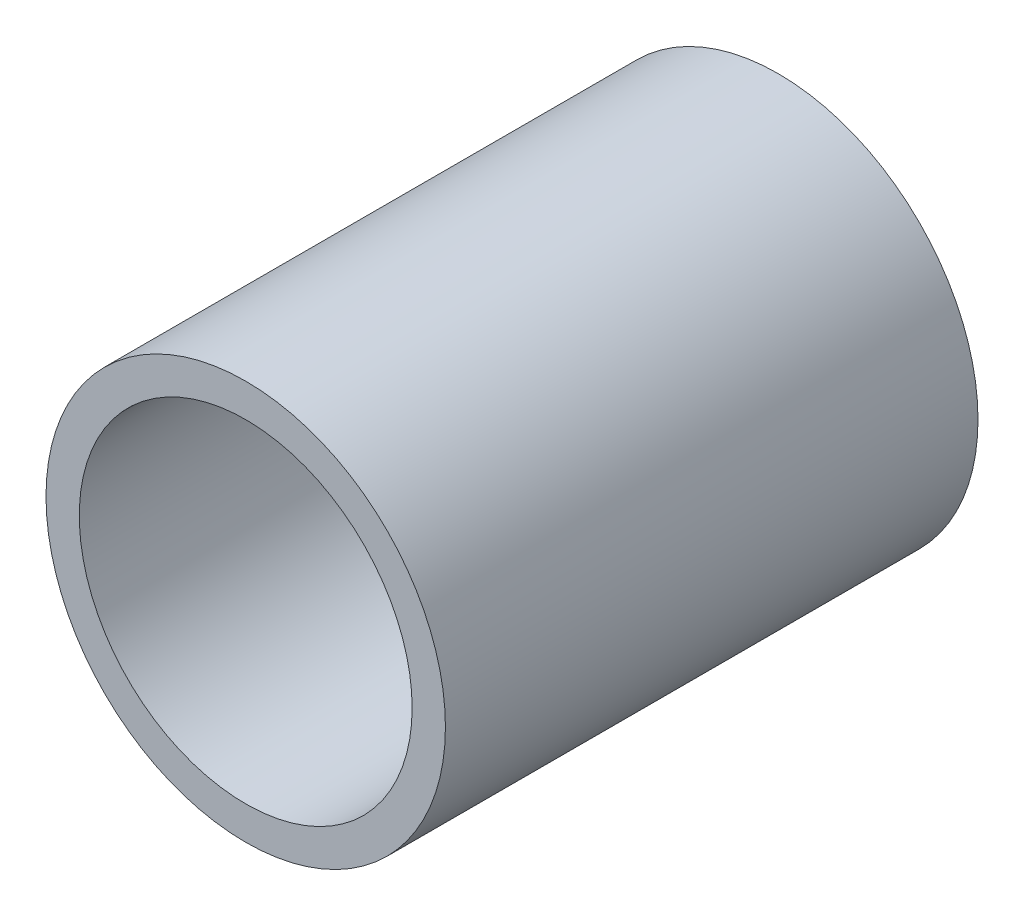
ISO-10303-21;
HEADER;
FILE_DESCRIPTION(('STEP AP214'),'2;1');
FILE_NAME('part.step','',(''),(''),'','','');
FILE_SCHEMA(('AUTOMOTIVE_DESIGN { 1 0 10303 214 1 1 1 1 }'));
ENDSEC;
DATA;
#1=APPLICATION_CONTEXT('core data for automotive mechanical design processes');
#2=APPLICATION_PROTOCOL_DEFINITION('international standard','automotive_design',2000,#1);
#3=PRODUCT_CONTEXT('',#1,'mechanical');
#4=PRODUCT('Part','Part','',(#3));
#5=PRODUCT_RELATED_PRODUCT_CATEGORY('part','',(#4));
#6=PRODUCT_DEFINITION_FORMATION('','',#4);
#7=PRODUCT_DEFINITION_CONTEXT('part definition',#1,'design');
#8=PRODUCT_DEFINITION('design','',#6,#7);
#9=PRODUCT_DEFINITION_SHAPE('','',#8);
#10=(LENGTH_UNIT() NAMED_UNIT(*) SI_UNIT(.MILLI.,.METRE.));
#11=(NAMED_UNIT(*) PLANE_ANGLE_UNIT() SI_UNIT($,.RADIAN.));
#12=(NAMED_UNIT(*) SI_UNIT($,.STERADIAN.) SOLID_ANGLE_UNIT());
#13=UNCERTAINTY_MEASURE_WITH_UNIT(LENGTH_MEASURE(1.E-05),#10,'distance_accuracy_value','');
#14=(GEOMETRIC_REPRESENTATION_CONTEXT(3) GLOBAL_UNCERTAINTY_ASSIGNED_CONTEXT((#13)) GLOBAL_UNIT_ASSIGNED_CONTEXT((#10,
#11,#12)) REPRESENTATION_CONTEXT('',''));
#15=CARTESIAN_POINT('',(0.,0.,0.));
#16=DIRECTION('',(0.,0.,1.));
#17=DIRECTION('',(1.,0.,0.));
#18=AXIS2_PLACEMENT_3D('',#15,#16,#17);
#19=CARTESIAN_POINT('',(0.,0.,50.8));
#20=DIRECTION('',(0.,0.,1.));
#21=DIRECTION('',(1.,0.,0.));
#22=AXIS2_PLACEMENT_3D('',#19,#20,#21);
#23=PLANE('',#22);
#24=CARTESIAN_POINT('',(0.,0.,50.8));
#25=DIRECTION('',(0.,0.,1.));
#26=DIRECTION('',(1.,0.,0.));
#27=AXIS2_PLACEMENT_3D('',#24,#25,#26);
#28=CIRCLE('',#27,19.05);
#29=CARTESIAN_POINT('',(19.05,0.,50.8));
#30=VERTEX_POINT('',#29);
#31=EDGE_CURVE('E10',#30,#30,#28,.T.);
#32=ORIENTED_EDGE('',*,*,#31,.T.);
#33=EDGE_LOOP('',(#32));
#34=FACE_BOUND('',#33,.T.);
#35=CARTESIAN_POINT('',(0.,0.,50.8));
#36=DIRECTION('',(0.,0.,1.));
#37=DIRECTION('',(1.,0.,0.));
#38=AXIS2_PLACEMENT_3D('',#35,#36,#37);
#39=CIRCLE('',#38,15.875);
#40=CARTESIAN_POINT('',(15.875,0.,50.8));
#41=VERTEX_POINT('',#40);
#42=EDGE_CURVE('E39',#41,#41,#39,.T.);
#43=ORIENTED_EDGE('',*,*,#42,.F.);
#44=EDGE_LOOP('',(#43));
#45=FACE_BOUND('',#44,.T.);
#46=ADVANCED_FACE('F28',(#34,#45),#23,.T.);
#47=CARTESIAN_POINT('',(0.,0.,0.));
#48=DIRECTION('',(0.,0.,1.));
#49=DIRECTION('',(1.,0.,0.));
#50=AXIS2_PLACEMENT_3D('',#47,#48,#49);
#51=PLANE('',#50);
#52=CARTESIAN_POINT('',(0.,0.,0.));
#53=DIRECTION('',(0.,0.,1.));
#54=DIRECTION('',(1.,0.,0.));
#55=AXIS2_PLACEMENT_3D('',#52,#53,#54);
#56=CIRCLE('',#55,19.05);
#57=CARTESIAN_POINT('',(19.05,0.,0.));
#58=VERTEX_POINT('',#57);
#59=EDGE_CURVE('E35',#58,#58,#56,.T.);
#60=ORIENTED_EDGE('',*,*,#59,.F.);
#61=EDGE_LOOP('',(#60));
#62=FACE_BOUND('',#61,.T.);
#63=CARTESIAN_POINT('',(0.,0.,0.));
#64=DIRECTION('',(0.,0.,1.));
#65=DIRECTION('',(1.,0.,0.));
#66=AXIS2_PLACEMENT_3D('',#63,#64,#65);
#67=CIRCLE('',#66,15.875);
#68=CARTESIAN_POINT('',(15.875,0.,0.));
#69=VERTEX_POINT('',#68);
#70=EDGE_CURVE('E43',#69,#69,#67,.T.);
#71=ORIENTED_EDGE('',*,*,#70,.T.);
#72=EDGE_LOOP('',(#71));
#73=FACE_BOUND('',#72,.T.);
#74=ADVANCED_FACE('F49',(#62,#73),#51,.F.);
#75=CARTESIAN_POINT('',(0.,0.,50.8));
#76=DIRECTION('',(0.,0.,-1.));
#77=DIRECTION('',(-1.,0.,0.));
#78=AXIS2_PLACEMENT_3D('',#75,#76,#77);
#79=CYLINDRICAL_SURFACE('',#78,19.05);
#80=ORIENTED_EDGE('',*,*,#31,.F.);
#81=EDGE_LOOP('',(#80));
#82=FACE_BOUND('',#81,.T.);
#83=ORIENTED_EDGE('',*,*,#59,.T.);
#84=EDGE_LOOP('',(#83));
#85=FACE_BOUND('',#84,.T.);
#86=ADVANCED_FACE('F30',(#82,#85),#79,.T.);
#87=CARTESIAN_POINT('',(0.,0.,50.8));
#88=DIRECTION('',(0.,0.,-1.));
#89=DIRECTION('',(-1.,0.,0.));
#90=AXIS2_PLACEMENT_3D('',#87,#88,#89);
#91=CYLINDRICAL_SURFACE('',#90,15.875);
#92=ORIENTED_EDGE('',*,*,#42,.T.);
#93=EDGE_LOOP('',(#92));
#94=FACE_BOUND('',#93,.T.);
#95=ORIENTED_EDGE('',*,*,#70,.F.);
#96=EDGE_LOOP('',(#95));
#97=FACE_BOUND('',#96,.T.);
#98=ADVANCED_FACE('F51',(#94,#97),#91,.F.);
#99=CLOSED_SHELL('',(#46,#74,#86,#98));
#100=MANIFOLD_SOLID_BREP('B2',#99);
#101=ADVANCED_BREP_SHAPE_REPRESENTATION('',(#18,#100),#14);
#102=SHAPE_DEFINITION_REPRESENTATION(#9,#101);
ENDSEC;
END-ISO-10303-21;
